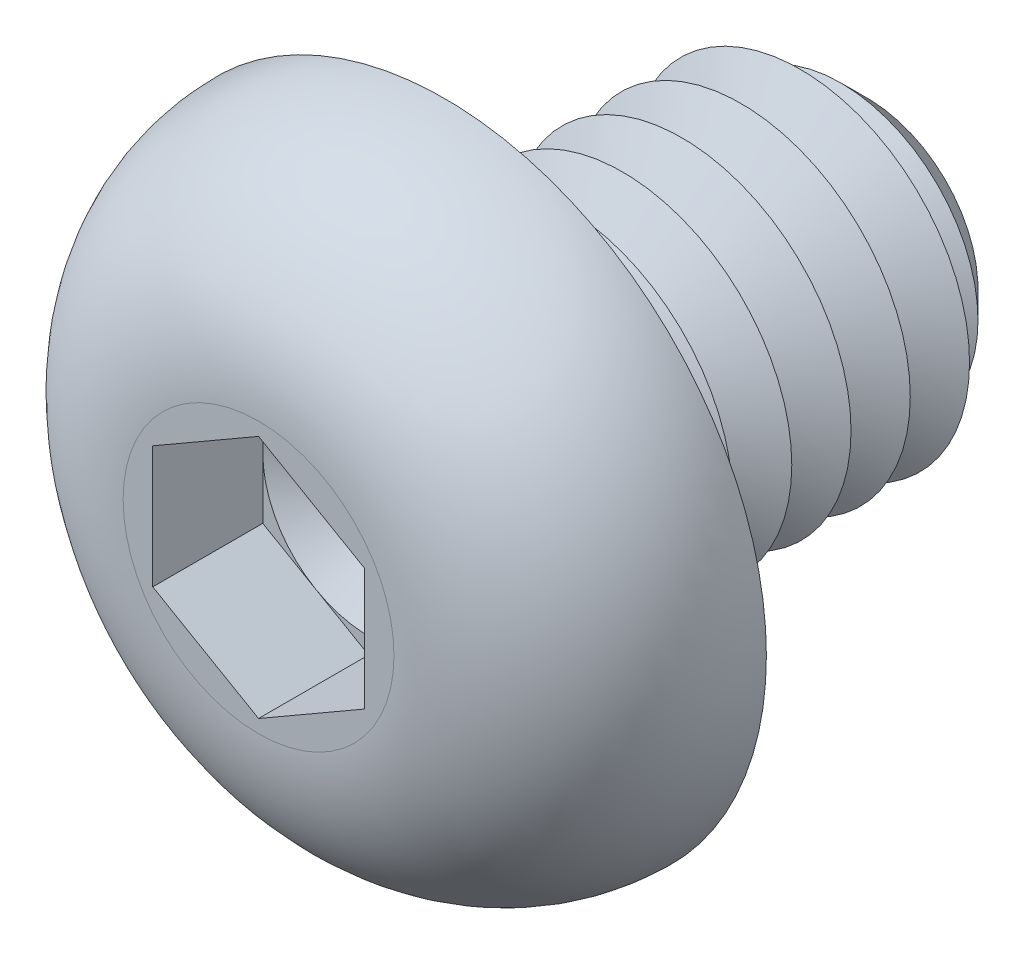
ISO-10303-21;
HEADER;
FILE_DESCRIPTION(('STEP AP214'),'2;1');
FILE_NAME('part.step','',(''),(''),'','','');
FILE_SCHEMA(('AUTOMOTIVE_DESIGN { 1 0 10303 214 1 1 1 1 }'));
ENDSEC;
DATA;
#1=APPLICATION_CONTEXT('core data for automotive mechanical design processes');
#2=APPLICATION_PROTOCOL_DEFINITION('international standard','automotive_design',2000,#1);
#3=PRODUCT_CONTEXT('',#1,'mechanical');
#4=PRODUCT('Part','Part','',(#3));
#5=PRODUCT_RELATED_PRODUCT_CATEGORY('part','',(#4));
#6=PRODUCT_DEFINITION_FORMATION('','',#4);
#7=PRODUCT_DEFINITION_CONTEXT('part definition',#1,'design');
#8=PRODUCT_DEFINITION('design','',#6,#7);
#9=PRODUCT_DEFINITION_SHAPE('','',#8);
#10=(LENGTH_UNIT() NAMED_UNIT(*) SI_UNIT(.MILLI.,.METRE.));
#11=(NAMED_UNIT(*) PLANE_ANGLE_UNIT() SI_UNIT($,.RADIAN.));
#12=(NAMED_UNIT(*) SI_UNIT($,.STERADIAN.) SOLID_ANGLE_UNIT());
#13=UNCERTAINTY_MEASURE_WITH_UNIT(LENGTH_MEASURE(1.E-05),#10,'distance_accuracy_value','');
#14=(GEOMETRIC_REPRESENTATION_CONTEXT(3) GLOBAL_UNCERTAINTY_ASSIGNED_CONTEXT((#13)) GLOBAL_UNIT_ASSIGNED_CONTEXT((#10,
#11,#12)) REPRESENTATION_CONTEXT('',''));
#15=CARTESIAN_POINT('',(0.,0.,0.));
#16=DIRECTION('',(0.,0.,1.));
#17=DIRECTION('',(1.,0.,0.));
#18=AXIS2_PLACEMENT_3D('',#15,#16,#17);
#19=CARTESIAN_POINT('',(0.,0.,0.900000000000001));
#20=DIRECTION('',(0.,0.,1.));
#21=DIRECTION('',(1.,0.,0.));
#22=AXIS2_PLACEMENT_3D('',#19,#20,#21);
#23=PLANE('',#22);
#24=CARTESIAN_POINT('',(0.,0.,0.900000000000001));
#25=DIRECTION('',(0.,0.,1.));
#26=DIRECTION('',(1.,0.,0.));
#27=AXIS2_PLACEMENT_3D('',#24,#25,#26);
#28=CIRCLE('',#27,1.25);
#29=CARTESIAN_POINT('',(1.25,0.,0.900000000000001));
#30=VERTEX_POINT('',#29);
#31=CARTESIAN_POINT('',(0.625,1.08253175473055,0.900000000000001));
#32=VERTEX_POINT('',#31);
#33=EDGE_CURVE('E117',#30,#32,#28,.T.);
#34=ORIENTED_EDGE('',*,*,#33,.F.);
#35=DIRECTION('',(0.,1.,0.));
#36=VECTOR('',#35,1.);
#37=CARTESIAN_POINT('',(1.25,-0.721687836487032,0.900000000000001));
#38=LINE('',#37,#36);
#39=CARTESIAN_POINT('',(1.25,0.721687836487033,0.900000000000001));
#40=VERTEX_POINT('',#39);
#41=EDGE_CURVE('E140',#30,#40,#38,.T.);
#42=ORIENTED_EDGE('',*,*,#41,.T.);
#43=DIRECTION('',(-0.866025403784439,0.5,0.));
#44=VECTOR('',#43,1.);
#45=CARTESIAN_POINT('',(1.25,0.721687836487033,0.900000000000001));
#46=LINE('',#45,#44);
#47=EDGE_CURVE('E135',#40,#32,#46,.T.);
#48=ORIENTED_EDGE('',*,*,#47,.T.);
#49=EDGE_LOOP('',(#34,#42,#48));
#50=FACE_BOUND('',#49,.T.);
#51=ADVANCED_FACE('F39',(#50),#23,.T.);
#52=CARTESIAN_POINT('',(0.,0.,0.900000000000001));
#53=DIRECTION('',(0.,0.,1.));
#54=DIRECTION('',(1.,0.,0.));
#55=AXIS2_PLACEMENT_3D('',#52,#53,#54);
#56=CIRCLE('',#55,1.25);
#57=CARTESIAN_POINT('',(-0.625,1.08253175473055,0.900000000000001));
#58=VERTEX_POINT('',#57);
#59=EDGE_CURVE('E11',#32,#58,#56,.T.);
#60=ORIENTED_EDGE('',*,*,#59,.F.);
#61=CARTESIAN_POINT('',(0.,1.44337567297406,0.900000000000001));
#62=VERTEX_POINT('',#61);
#63=EDGE_CURVE('E130',#32,#62,#46,.T.);
#64=ORIENTED_EDGE('',*,*,#63,.T.);
#65=DIRECTION('',(-0.866025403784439,-0.5,0.));
#66=VECTOR('',#65,1.);
#67=CARTESIAN_POINT('',(0.,1.44337567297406,0.900000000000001));
#68=LINE('',#67,#66);
#69=EDGE_CURVE('E132',#62,#58,#68,.T.);
#70=ORIENTED_EDGE('',*,*,#69,.T.);
#71=EDGE_LOOP('',(#60,#64,#70));
#72=FACE_BOUND('',#71,.T.);
#73=ADVANCED_FACE('F129',(#72),#23,.T.);
#74=CARTESIAN_POINT('',(-1.25,0.,0.900000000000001));
#75=VERTEX_POINT('',#74);
#76=EDGE_CURVE('E49',#58,#75,#56,.T.);
#77=ORIENTED_EDGE('',*,*,#76,.F.);
#78=CARTESIAN_POINT('',(-1.25,0.721687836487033,0.900000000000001));
#79=VERTEX_POINT('',#78);
#80=EDGE_CURVE('E143',#58,#79,#68,.T.);
#81=ORIENTED_EDGE('',*,*,#80,.T.);
#82=DIRECTION('',(0.,-1.,0.));
#83=VECTOR('',#82,1.);
#84=CARTESIAN_POINT('',(-1.25,0.721687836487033,0.900000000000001));
#85=LINE('',#84,#83);
#86=EDGE_CURVE('E154',#79,#75,#85,.T.);
#87=ORIENTED_EDGE('',*,*,#86,.T.);
#88=EDGE_LOOP('',(#77,#81,#87));
#89=FACE_BOUND('',#88,.T.);
#90=ADVANCED_FACE('F254',(#89),#23,.T.);
#91=CARTESIAN_POINT('',(-0.625,-1.08253175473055,0.900000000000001));
#92=VERTEX_POINT('',#91);
#93=EDGE_CURVE('E238',#75,#92,#56,.T.);
#94=ORIENTED_EDGE('',*,*,#93,.F.);
#95=CARTESIAN_POINT('',(-1.25,-0.721687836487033,0.900000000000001));
#96=VERTEX_POINT('',#95);
#97=EDGE_CURVE('E153',#75,#96,#85,.T.);
#98=ORIENTED_EDGE('',*,*,#97,.T.);
#99=DIRECTION('',(0.866025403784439,-0.5,0.));
#100=VECTOR('',#99,1.);
#101=CARTESIAN_POINT('',(-1.25,-0.721687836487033,0.900000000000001));
#102=LINE('',#101,#100);
#103=EDGE_CURVE('E159',#96,#92,#102,.T.);
#104=ORIENTED_EDGE('',*,*,#103,.T.);
#105=EDGE_LOOP('',(#94,#98,#104));
#106=FACE_BOUND('',#105,.T.);
#107=ADVANCED_FACE('F247',(#106),#23,.T.);
#108=CARTESIAN_POINT('',(0.625,-1.08253175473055,0.900000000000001));
#109=VERTEX_POINT('',#108);
#110=EDGE_CURVE('E56',#92,#109,#56,.T.);
#111=ORIENTED_EDGE('',*,*,#110,.F.);
#112=CARTESIAN_POINT('',(0.,-1.44337567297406,0.900000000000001));
#113=VERTEX_POINT('',#112);
#114=EDGE_CURVE('E158',#92,#113,#102,.T.);
#115=ORIENTED_EDGE('',*,*,#114,.T.);
#116=DIRECTION('',(0.866025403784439,0.5,0.));
#117=VECTOR('',#116,1.);
#118=CARTESIAN_POINT('',(0.,-1.44337567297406,0.900000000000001));
#119=LINE('',#118,#117);
#120=EDGE_CURVE('E164',#113,#109,#119,.T.);
#121=ORIENTED_EDGE('',*,*,#120,.T.);
#122=EDGE_LOOP('',(#111,#115,#121));
#123=FACE_BOUND('',#122,.T.);
#124=ADVANCED_FACE('F315',(#123),#23,.T.);
#125=CARTESIAN_POINT('',(0.,0.,-5.));
#126=DIRECTION('',(0.,0.,1.));
#127=DIRECTION('',(1.,0.,0.));
#128=AXIS2_PLACEMENT_3D('',#125,#126,#127);
#129=CYLINDRICAL_SURFACE('',#128,2.);
#130=CARTESIAN_POINT('',(0.,0.,-0.3));
#131=DIRECTION('',(0.,0.,1.));
#132=DIRECTION('',(1.,0.,0.));
#133=AXIS2_PLACEMENT_3D('',#130,#131,#132);
#134=CIRCLE('',#133,2.);
#135=CARTESIAN_POINT('',(2.,0.,-0.3));
#136=VERTEX_POINT('',#135);
#137=EDGE_CURVE('E220',#136,#136,#134,.F.);
#138=ORIENTED_EDGE('',*,*,#137,.T.);
#139=EDGE_LOOP('',(#138));
#140=FACE_BOUND('',#139,.T.);
#141=CARTESIAN_POINT('',(0.,0.,-0.699999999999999));
#142=DIRECTION('',(0.,0.,1.));
#143=DIRECTION('',(1.,0.,0.));
#144=AXIS2_PLACEMENT_3D('',#141,#142,#143);
#145=CIRCLE('',#144,2.);
#146=CARTESIAN_POINT('',(2.,0.,-0.699999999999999));
#147=VERTEX_POINT('',#146);
#148=EDGE_CURVE('E149',#147,#147,#145,.T.);
#149=ORIENTED_EDGE('',*,*,#148,.T.);
#150=EDGE_LOOP('',(#149));
#151=FACE_BOUND('',#150,.T.);
#152=ADVANCED_FACE('F299',(#140,#151),#129,.T.);
#153=CARTESIAN_POINT('',(0.,3.8,0.));
#154=DIRECTION('',(0.,0.,1.));
#155=DIRECTION('',(1.,0.,0.));
#156=AXIS2_PLACEMENT_3D('',#153,#154,#155);
#157=PLANE('',#156);
#158=CARTESIAN_POINT('',(0.,0.,0.));
#159=DIRECTION('',(0.,0.,1.));
#160=DIRECTION('',(1.,0.,0.));
#161=AXIS2_PLACEMENT_3D('',#158,#159,#160);
#162=CIRCLE('',#161,2.3);
#163=CARTESIAN_POINT('',(2.3,0.,0.));
#164=VERTEX_POINT('',#163);
#165=EDGE_CURVE('E229',#164,#164,#162,.T.);
#166=ORIENTED_EDGE('',*,*,#165,.T.);
#167=EDGE_LOOP('',(#166));
#168=FACE_BOUND('',#167,.T.);
#169=CARTESIAN_POINT('',(0.,0.,0.));
#170=DIRECTION('',(0.,0.,1.));
#171=DIRECTION('',(1.,0.,0.));
#172=AXIS2_PLACEMENT_3D('',#169,#170,#171);
#173=CIRCLE('',#172,3.8);
#174=CARTESIAN_POINT('',(3.8,0.,0.));
#175=VERTEX_POINT('',#174);
#176=EDGE_CURVE('E195',#175,#175,#173,.T.);
#177=ORIENTED_EDGE('',*,*,#176,.F.);
#178=EDGE_LOOP('',(#177));
#179=FACE_BOUND('',#178,.T.);
#180=ADVANCED_FACE('F345',(#168,#179),#157,.F.);
#181=CARTESIAN_POINT('',(0.,0.,2.2));
#182=DIRECTION('',(0.,0.,-1.));
#183=DIRECTION('',(-1.,0.,0.));
#184=AXIS2_PLACEMENT_3D('',#181,#182,#183);
#185=PLANE('',#184);
#186=DIRECTION('',(-0.866025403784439,-0.5,0.));
#187=VECTOR('',#186,1.);
#188=CARTESIAN_POINT('',(0.,1.44337567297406,2.2));
#189=LINE('',#188,#187);
#190=CARTESIAN_POINT('',(0.,1.44337567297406,2.2));
#191=VERTEX_POINT('',#190);
#192=CARTESIAN_POINT('',(-1.25,0.721687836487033,2.2));
#193=VERTEX_POINT('',#192);
#194=EDGE_CURVE('E174',#191,#193,#189,.T.);
#195=ORIENTED_EDGE('',*,*,#194,.F.);
#196=DIRECTION('',(-0.866025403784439,0.5,0.));
#197=VECTOR('',#196,1.);
#198=CARTESIAN_POINT('',(1.25,0.721687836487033,2.2));
#199=LINE('',#198,#197);
#200=CARTESIAN_POINT('',(1.25,0.721687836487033,2.2));
#201=VERTEX_POINT('',#200);
#202=EDGE_CURVE('E64',#201,#191,#199,.T.);
#203=ORIENTED_EDGE('',*,*,#202,.F.);
#204=DIRECTION('',(0.,1.,0.));
#205=VECTOR('',#204,1.);
#206=CARTESIAN_POINT('',(1.25,-0.721687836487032,2.2));
#207=LINE('',#206,#205);
#208=CARTESIAN_POINT('',(1.25,-0.721687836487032,2.2));
#209=VERTEX_POINT('',#208);
#210=EDGE_CURVE('E138',#209,#201,#207,.T.);
#211=ORIENTED_EDGE('',*,*,#210,.F.);
#212=DIRECTION('',(0.866025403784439,0.5,0.));
#213=VECTOR('',#212,1.);
#214=CARTESIAN_POINT('',(0.,-1.44337567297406,2.2));
#215=LINE('',#214,#213);
#216=CARTESIAN_POINT('',(0.,-1.44337567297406,2.2));
#217=VERTEX_POINT('',#216);
#218=EDGE_CURVE('E185',#217,#209,#215,.T.);
#219=ORIENTED_EDGE('',*,*,#218,.F.);
#220=DIRECTION('',(0.866025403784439,-0.5,0.));
#221=VECTOR('',#220,1.);
#222=CARTESIAN_POINT('',(-1.25,-0.721687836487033,2.2));
#223=LINE('',#222,#221);
#224=CARTESIAN_POINT('',(-1.25,-0.721687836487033,2.2));
#225=VERTEX_POINT('',#224);
#226=EDGE_CURVE('E181',#225,#217,#223,.T.);
#227=ORIENTED_EDGE('',*,*,#226,.F.);
#228=DIRECTION('',(0.,-1.,0.));
#229=VECTOR('',#228,1.);
#230=CARTESIAN_POINT('',(-1.25,0.721687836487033,2.2));
#231=LINE('',#230,#229);
#232=EDGE_CURVE('E178',#193,#225,#231,.T.);
#233=ORIENTED_EDGE('',*,*,#232,.F.);
#234=EDGE_LOOP('',(#195,#203,#211,#219,#227,#233));
#235=FACE_BOUND('',#234,.T.);
#236=CARTESIAN_POINT('',(0.,0.,2.2));
#237=DIRECTION('',(0.,0.,1.));
#238=DIRECTION('',(1.,0.,0.));
#239=AXIS2_PLACEMENT_3D('',#236,#237,#238);
#240=CIRCLE('',#239,1.6);
#241=CARTESIAN_POINT('',(1.6,0.,2.2));
#242=VERTEX_POINT('',#241);
#243=EDGE_CURVE('E212',#242,#242,#240,.T.);
#244=ORIENTED_EDGE('',*,*,#243,.T.);
#245=EDGE_LOOP('',(#244));
#246=FACE_BOUND('',#245,.T.);
#247=ADVANCED_FACE('F263',(#235,#246),#185,.F.);
#248=CARTESIAN_POINT('',(0.,0.,0.));
#249=DIRECTION('',(0.,0.,1.));
#250=DIRECTION('',(1.,0.,0.));
#251=AXIS2_PLACEMENT_3D('',#248,#249,#250);
#252=DEGENERATE_TOROIDAL_SURFACE('',#251,1.6,2.2,.T.);
#253=ORIENTED_EDGE('',*,*,#243,.F.);
#254=EDGE_LOOP('',(#253));
#255=FACE_BOUND('',#254,.T.);
#256=ORIENTED_EDGE('',*,*,#176,.T.);
#257=EDGE_LOOP('',(#256));
#258=FACE_BOUND('',#257,.T.);
#259=ADVANCED_FACE('F339',(#255,#258),#252,.T.);
#260=CARTESIAN_POINT('',(1.25,0.721687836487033,0.900000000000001));
#261=DIRECTION('',(0.5,0.866025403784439,0.));
#262=DIRECTION('',(-0.866025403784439,0.5,0.));
#263=AXIS2_PLACEMENT_3D('',#260,#261,#262);
#264=PLANE('',#263);
#265=ORIENTED_EDGE('',*,*,#202,.T.);
#266=DIRECTION('',(0.,0.,1.));
#267=VECTOR('',#266,1.);
#268=CARTESIAN_POINT('',(0.,1.44337567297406,0.900000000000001));
#269=LINE('',#268,#267);
#270=EDGE_CURVE('E136',#62,#191,#269,.T.);
#271=ORIENTED_EDGE('',*,*,#270,.F.);
#272=ORIENTED_EDGE('',*,*,#63,.F.);
#273=ORIENTED_EDGE('',*,*,#47,.F.);
#274=DIRECTION('',(0.,0.,1.));
#275=VECTOR('',#274,1.);
#276=CARTESIAN_POINT('',(1.25,0.721687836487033,0.900000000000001));
#277=LINE('',#276,#275);
#278=EDGE_CURVE('E192',#40,#201,#277,.T.);
#279=ORIENTED_EDGE('',*,*,#278,.T.);
#280=EDGE_LOOP('',(#265,#271,#272,#273,#279));
#281=FACE_BOUND('',#280,.T.);
#282=ADVANCED_FACE('F134',(#281),#264,.F.);
#283=CARTESIAN_POINT('',(1.25,-0.721687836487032,0.900000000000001));
#284=DIRECTION('',(1.,0.,0.));
#285=DIRECTION('',(0.,1.,0.));
#286=AXIS2_PLACEMENT_3D('',#283,#284,#285);
#287=PLANE('',#286);
#288=ORIENTED_EDGE('',*,*,#210,.T.);
#289=ORIENTED_EDGE('',*,*,#278,.F.);
#290=ORIENTED_EDGE('',*,*,#41,.F.);
#291=CARTESIAN_POINT('',(1.25,-0.721687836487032,0.900000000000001));
#292=VERTEX_POINT('',#291);
#293=EDGE_CURVE('E168',#292,#30,#38,.T.);
#294=ORIENTED_EDGE('',*,*,#293,.F.);
#295=DIRECTION('',(0.,0.,1.));
#296=VECTOR('',#295,1.);
#297=CARTESIAN_POINT('',(1.25,-0.721687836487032,0.900000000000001));
#298=LINE('',#297,#296);
#299=EDGE_CURVE('E196',#292,#209,#298,.T.);
#300=ORIENTED_EDGE('',*,*,#299,.T.);
#301=EDGE_LOOP('',(#288,#289,#290,#294,#300));
#302=FACE_BOUND('',#301,.T.);
#303=ADVANCED_FACE('F323',(#302),#287,.F.);
#304=CARTESIAN_POINT('',(0.,-1.44337567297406,0.900000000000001));
#305=DIRECTION('',(0.5,-0.866025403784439,0.));
#306=DIRECTION('',(0.866025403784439,0.5,0.));
#307=AXIS2_PLACEMENT_3D('',#304,#305,#306);
#308=PLANE('',#307);
#309=ORIENTED_EDGE('',*,*,#218,.T.);
#310=ORIENTED_EDGE('',*,*,#299,.F.);
#311=EDGE_CURVE('E163',#109,#292,#119,.T.);
#312=ORIENTED_EDGE('',*,*,#311,.F.);
#313=ORIENTED_EDGE('',*,*,#120,.F.);
#314=DIRECTION('',(0.,0.,1.));
#315=VECTOR('',#314,1.);
#316=CARTESIAN_POINT('',(0.,-1.44337567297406,0.900000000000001));
#317=LINE('',#316,#315);
#318=EDGE_CURVE('E199',#113,#217,#317,.T.);
#319=ORIENTED_EDGE('',*,*,#318,.T.);
#320=EDGE_LOOP('',(#309,#310,#312,#313,#319));
#321=FACE_BOUND('',#320,.T.);
#322=ADVANCED_FACE('F326',(#321),#308,.F.);
#323=CARTESIAN_POINT('',(-1.25,-0.721687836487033,0.900000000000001));
#324=DIRECTION('',(-0.5,-0.866025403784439,0.));
#325=DIRECTION('',(0.866025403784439,-0.5,0.));
#326=AXIS2_PLACEMENT_3D('',#323,#324,#325);
#327=PLANE('',#326);
#328=ORIENTED_EDGE('',*,*,#226,.T.);
#329=ORIENTED_EDGE('',*,*,#318,.F.);
#330=ORIENTED_EDGE('',*,*,#114,.F.);
#331=ORIENTED_EDGE('',*,*,#103,.F.);
#332=DIRECTION('',(0.,0.,1.));
#333=VECTOR('',#332,1.);
#334=CARTESIAN_POINT('',(-1.25,-0.721687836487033,0.900000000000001));
#335=LINE('',#334,#333);
#336=EDGE_CURVE('E201',#96,#225,#335,.T.);
#337=ORIENTED_EDGE('',*,*,#336,.T.);
#338=EDGE_LOOP('',(#328,#329,#330,#331,#337));
#339=FACE_BOUND('',#338,.T.);
#340=ADVANCED_FACE('F268',(#339),#327,.F.);
#341=CARTESIAN_POINT('',(-1.25,0.721687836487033,0.900000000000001));
#342=DIRECTION('',(-1.,0.,0.));
#343=DIRECTION('',(0.,0.,1.));
#344=AXIS2_PLACEMENT_3D('',#341,#342,#343);
#345=PLANE('',#344);
#346=ORIENTED_EDGE('',*,*,#232,.T.);
#347=ORIENTED_EDGE('',*,*,#336,.F.);
#348=ORIENTED_EDGE('',*,*,#97,.F.);
#349=ORIENTED_EDGE('',*,*,#86,.F.);
#350=DIRECTION('',(0.,0.,1.));
#351=VECTOR('',#350,1.);
#352=CARTESIAN_POINT('',(-1.25,0.721687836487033,0.900000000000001));
#353=LINE('',#352,#351);
#354=EDGE_CURVE('E204',#79,#193,#353,.T.);
#355=ORIENTED_EDGE('',*,*,#354,.T.);
#356=EDGE_LOOP('',(#346,#347,#348,#349,#355));
#357=FACE_BOUND('',#356,.T.);
#358=ADVANCED_FACE('F252',(#357),#345,.F.);
#359=CARTESIAN_POINT('',(0.,1.44337567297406,0.900000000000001));
#360=DIRECTION('',(-0.5,0.866025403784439,0.));
#361=DIRECTION('',(-0.866025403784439,-0.5,0.));
#362=AXIS2_PLACEMENT_3D('',#359,#360,#361);
#363=PLANE('',#362);
#364=ORIENTED_EDGE('',*,*,#194,.T.);
#365=ORIENTED_EDGE('',*,*,#354,.F.);
#366=ORIENTED_EDGE('',*,*,#80,.F.);
#367=ORIENTED_EDGE('',*,*,#69,.F.);
#368=ORIENTED_EDGE('',*,*,#270,.T.);
#369=EDGE_LOOP('',(#364,#365,#366,#367,#368));
#370=FACE_BOUND('',#369,.T.);
#371=ADVANCED_FACE('F257',(#370),#363,.F.);
#372=EDGE_CURVE('E43',#109,#30,#56,.T.);
#373=ORIENTED_EDGE('',*,*,#372,.F.);
#374=ORIENTED_EDGE('',*,*,#311,.T.);
#375=ORIENTED_EDGE('',*,*,#293,.T.);
#376=EDGE_LOOP('',(#373,#374,#375));
#377=FACE_BOUND('',#376,.T.);
#378=ADVANCED_FACE('F304',(#377),#23,.T.);
#379=CARTESIAN_POINT('',(0.,0.,-0.699999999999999));
#380=DIRECTION('',(0.,0.,1.));
#381=DIRECTION('',(1.,0.,0.));
#382=AXIS2_PLACEMENT_3D('',#379,#380,#381);
#383=CONICAL_SURFACE('',#382,2.,1.04719755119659);
#384=CARTESIAN_POINT('',(0.,0.,-1.05));
#385=DIRECTION('',(0.,0.,1.));
#386=DIRECTION('',(1.,0.,0.));
#387=AXIS2_PLACEMENT_3D('',#384,#385,#386);
#388=CIRCLE('',#387,1.3937822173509);
#389=CARTESIAN_POINT('',(1.3937822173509,0.,-1.05));
#390=VERTEX_POINT('',#389);
#391=EDGE_CURVE('E283',#390,#390,#388,.T.);
#392=ORIENTED_EDGE('',*,*,#391,.T.);
#393=EDGE_LOOP('',(#392));
#394=FACE_BOUND('',#393,.T.);
#395=ORIENTED_EDGE('',*,*,#148,.F.);
#396=EDGE_LOOP('',(#395));
#397=FACE_BOUND('',#396,.T.);
#398=ADVANCED_FACE('F301',(#394,#397),#383,.T.);
#399=CARTESIAN_POINT('',(0.,0.,-1.05));
#400=DIRECTION('',(0.,0.,-1.));
#401=DIRECTION('',(-1.,0.,0.));
#402=AXIS2_PLACEMENT_3D('',#399,#400,#401);
#403=CONICAL_SURFACE('',#402,1.3937822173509,1.0471975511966);
#404=CARTESIAN_POINT('',(0.,0.,-1.4));
#405=DIRECTION('',(0.,0.,1.));
#406=DIRECTION('',(1.,0.,0.));
#407=AXIS2_PLACEMENT_3D('',#404,#405,#406);
#408=CIRCLE('',#407,2.);
#409=CARTESIAN_POINT('',(2.,0.,-1.4));
#410=VERTEX_POINT('',#409);
#411=EDGE_CURVE('E276',#410,#410,#408,.T.);
#412=ORIENTED_EDGE('',*,*,#411,.T.);
#413=EDGE_LOOP('',(#412));
#414=FACE_BOUND('',#413,.T.);
#415=ORIENTED_EDGE('',*,*,#391,.F.);
#416=EDGE_LOOP('',(#415));
#417=FACE_BOUND('',#416,.T.);
#418=ADVANCED_FACE('F303',(#414,#417),#403,.T.);
#419=CARTESIAN_POINT('',(0.,0.,-1.4));
#420=DIRECTION('',(0.,0.,1.));
#421=DIRECTION('',(1.,0.,0.));
#422=AXIS2_PLACEMENT_3D('',#419,#420,#421);
#423=CONICAL_SURFACE('',#422,2.,1.04719755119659);
#424=CARTESIAN_POINT('',(0.,0.,-1.75));
#425=DIRECTION('',(0.,0.,1.));
#426=DIRECTION('',(1.,0.,0.));
#427=AXIS2_PLACEMENT_3D('',#424,#425,#426);
#428=CIRCLE('',#427,1.3937822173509);
#429=CARTESIAN_POINT('',(1.3937822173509,0.,-1.75));
#430=VERTEX_POINT('',#429);
#431=EDGE_CURVE('E274',#430,#430,#428,.T.);
#432=ORIENTED_EDGE('',*,*,#431,.T.);
#433=EDGE_LOOP('',(#432));
#434=FACE_BOUND('',#433,.T.);
#435=ORIENTED_EDGE('',*,*,#411,.F.);
#436=EDGE_LOOP('',(#435));
#437=FACE_BOUND('',#436,.T.);
#438=ADVANCED_FACE('F310',(#434,#437),#423,.T.);
#439=CARTESIAN_POINT('',(0.,0.,-1.75));
#440=DIRECTION('',(0.,0.,-1.));
#441=DIRECTION('',(-1.,0.,0.));
#442=AXIS2_PLACEMENT_3D('',#439,#440,#441);
#443=CONICAL_SURFACE('',#442,1.3937822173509,1.0471975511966);
#444=CARTESIAN_POINT('',(0.,0.,-2.1));
#445=DIRECTION('',(0.,0.,1.));
#446=DIRECTION('',(1.,0.,0.));
#447=AXIS2_PLACEMENT_3D('',#444,#445,#446);
#448=CIRCLE('',#447,2.);
#449=CARTESIAN_POINT('',(2.,0.,-2.1));
#450=VERTEX_POINT('',#449);
#451=EDGE_CURVE('E277',#450,#450,#448,.T.);
#452=ORIENTED_EDGE('',*,*,#451,.T.);
#453=EDGE_LOOP('',(#452));
#454=FACE_BOUND('',#453,.T.);
#455=ORIENTED_EDGE('',*,*,#431,.F.);
#456=EDGE_LOOP('',(#455));
#457=FACE_BOUND('',#456,.T.);
#458=ADVANCED_FACE('F405',(#454,#457),#443,.T.);
#459=CARTESIAN_POINT('',(0.,0.,-2.1));
#460=DIRECTION('',(0.,0.,1.));
#461=DIRECTION('',(1.,0.,0.));
#462=AXIS2_PLACEMENT_3D('',#459,#460,#461);
#463=CONICAL_SURFACE('',#462,2.,1.04719755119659);
#464=CARTESIAN_POINT('',(0.,0.,-2.45));
#465=DIRECTION('',(0.,0.,1.));
#466=DIRECTION('',(1.,0.,0.));
#467=AXIS2_PLACEMENT_3D('',#464,#465,#466);
#468=CIRCLE('',#467,1.3937822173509);
#469=CARTESIAN_POINT('',(1.3937822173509,0.,-2.45));
#470=VERTEX_POINT('',#469);
#471=EDGE_CURVE('E287',#470,#470,#468,.T.);
#472=ORIENTED_EDGE('',*,*,#471,.T.);
#473=EDGE_LOOP('',(#472));
#474=FACE_BOUND('',#473,.T.);
#475=ORIENTED_EDGE('',*,*,#451,.F.);
#476=EDGE_LOOP('',(#475));
#477=FACE_BOUND('',#476,.T.);
#478=ADVANCED_FACE('F390',(#474,#477),#463,.T.);
#479=CARTESIAN_POINT('',(0.,0.,-2.45));
#480=DIRECTION('',(0.,0.,-1.));
#481=DIRECTION('',(-1.,0.,0.));
#482=AXIS2_PLACEMENT_3D('',#479,#480,#481);
#483=CONICAL_SURFACE('',#482,1.3937822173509,1.0471975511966);
#484=CARTESIAN_POINT('',(0.,0.,-2.8));
#485=DIRECTION('',(0.,0.,1.));
#486=DIRECTION('',(1.,0.,0.));
#487=AXIS2_PLACEMENT_3D('',#484,#485,#486);
#488=CIRCLE('',#487,2.);
#489=CARTESIAN_POINT('',(2.,0.,-2.8));
#490=VERTEX_POINT('',#489);
#491=EDGE_CURVE('E385',#490,#490,#488,.T.);
#492=ORIENTED_EDGE('',*,*,#491,.T.);
#493=EDGE_LOOP('',(#492));
#494=FACE_BOUND('',#493,.T.);
#495=ORIENTED_EDGE('',*,*,#471,.F.);
#496=EDGE_LOOP('',(#495));
#497=FACE_BOUND('',#496,.T.);
#498=ADVANCED_FACE('F393',(#494,#497),#483,.T.);
#499=CARTESIAN_POINT('',(0.,0.,-2.8));
#500=DIRECTION('',(0.,0.,1.));
#501=DIRECTION('',(1.,0.,0.));
#502=AXIS2_PLACEMENT_3D('',#499,#500,#501);
#503=CONICAL_SURFACE('',#502,2.,1.04719755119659);
#504=CARTESIAN_POINT('',(0.,0.,-3.15));
#505=DIRECTION('',(0.,0.,1.));
#506=DIRECTION('',(1.,0.,0.));
#507=AXIS2_PLACEMENT_3D('',#504,#505,#506);
#508=CIRCLE('',#507,1.3937822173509);
#509=CARTESIAN_POINT('',(1.3937822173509,0.,-3.15));
#510=VERTEX_POINT('',#509);
#511=EDGE_CURVE('E381',#510,#510,#508,.T.);
#512=ORIENTED_EDGE('',*,*,#511,.T.);
#513=EDGE_LOOP('',(#512));
#514=FACE_BOUND('',#513,.T.);
#515=ORIENTED_EDGE('',*,*,#491,.F.);
#516=EDGE_LOOP('',(#515));
#517=FACE_BOUND('',#516,.T.);
#518=ADVANCED_FACE('F395',(#514,#517),#503,.T.);
#519=CARTESIAN_POINT('',(0.,0.,-3.15));
#520=DIRECTION('',(0.,0.,-1.));
#521=DIRECTION('',(-1.,0.,0.));
#522=AXIS2_PLACEMENT_3D('',#519,#520,#521);
#523=CONICAL_SURFACE('',#522,1.3937822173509,1.0471975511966);
#524=CARTESIAN_POINT('',(0.,0.,-3.5));
#525=DIRECTION('',(0.,0.,1.));
#526=DIRECTION('',(1.,0.,0.));
#527=AXIS2_PLACEMENT_3D('',#524,#525,#526);
#528=CIRCLE('',#527,2.);
#529=CARTESIAN_POINT('',(2.,0.,-3.5));
#530=VERTEX_POINT('',#529);
#531=EDGE_CURVE('E377',#530,#530,#528,.T.);
#532=ORIENTED_EDGE('',*,*,#531,.T.);
#533=EDGE_LOOP('',(#532));
#534=FACE_BOUND('',#533,.T.);
#535=ORIENTED_EDGE('',*,*,#511,.F.);
#536=EDGE_LOOP('',(#535));
#537=FACE_BOUND('',#536,.T.);
#538=ADVANCED_FACE('F402',(#534,#537),#523,.T.);
#539=CARTESIAN_POINT('',(0.,0.,-3.5));
#540=DIRECTION('',(0.,0.,1.));
#541=DIRECTION('',(1.,0.,0.));
#542=AXIS2_PLACEMENT_3D('',#539,#540,#541);
#543=CONICAL_SURFACE('',#542,2.,1.04719755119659);
#544=CARTESIAN_POINT('',(0.,0.,-3.85));
#545=DIRECTION('',(0.,0.,1.));
#546=DIRECTION('',(1.,0.,0.));
#547=AXIS2_PLACEMENT_3D('',#544,#545,#546);
#548=CIRCLE('',#547,1.3937822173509);
#549=CARTESIAN_POINT('',(1.3937822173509,0.,-3.85));
#550=VERTEX_POINT('',#549);
#551=EDGE_CURVE('E225',#550,#550,#548,.T.);
#552=ORIENTED_EDGE('',*,*,#551,.T.);
#553=EDGE_LOOP('',(#552));
#554=FACE_BOUND('',#553,.T.);
#555=ORIENTED_EDGE('',*,*,#531,.F.);
#556=EDGE_LOOP('',(#555));
#557=FACE_BOUND('',#556,.T.);
#558=ADVANCED_FACE('F441',(#554,#557),#543,.T.);
#559=CARTESIAN_POINT('',(0.,0.,-3.85));
#560=DIRECTION('',(0.,0.,-1.));
#561=DIRECTION('',(-1.,0.,0.));
#562=AXIS2_PLACEMENT_3D('',#559,#560,#561);
#563=CONICAL_SURFACE('',#562,1.3937822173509,1.0471975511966);
#564=CARTESIAN_POINT('',(0.,0.,-4.2));
#565=DIRECTION('',(0.,0.,1.));
#566=DIRECTION('',(1.,0.,0.));
#567=AXIS2_PLACEMENT_3D('',#564,#565,#566);
#568=CIRCLE('',#567,2.);
#569=CARTESIAN_POINT('',(2.,0.,-4.2));
#570=VERTEX_POINT('',#569);
#571=EDGE_CURVE('E226',#570,#570,#568,.T.);
#572=ORIENTED_EDGE('',*,*,#571,.T.);
#573=EDGE_LOOP('',(#572));
#574=FACE_BOUND('',#573,.T.);
#575=ORIENTED_EDGE('',*,*,#551,.F.);
#576=EDGE_LOOP('',(#575));
#577=FACE_BOUND('',#576,.T.);
#578=ADVANCED_FACE('F449',(#574,#577),#563,.T.);
#579=CARTESIAN_POINT('',(0.,0.,-4.2));
#580=DIRECTION('',(0.,0.,1.));
#581=DIRECTION('',(1.,0.,0.));
#582=AXIS2_PLACEMENT_3D('',#579,#580,#581);
#583=CONICAL_SURFACE('',#582,2.,1.04719755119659);
#584=CARTESIAN_POINT('',(0.,0.,-4.55));
#585=DIRECTION('',(0.,0.,1.));
#586=DIRECTION('',(1.,0.,0.));
#587=AXIS2_PLACEMENT_3D('',#584,#585,#586);
#588=CIRCLE('',#587,1.3937822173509);
#589=CARTESIAN_POINT('',(1.3937822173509,0.,-4.55));
#590=VERTEX_POINT('',#589);
#591=EDGE_CURVE('E124',#590,#590,#588,.T.);
#592=ORIENTED_EDGE('',*,*,#591,.T.);
#593=EDGE_LOOP('',(#592));
#594=FACE_BOUND('',#593,.T.);
#595=ORIENTED_EDGE('',*,*,#571,.F.);
#596=EDGE_LOOP('',(#595));
#597=FACE_BOUND('',#596,.T.);
#598=ADVANCED_FACE('F364',(#594,#597),#583,.T.);
#599=CARTESIAN_POINT('',(0.,0.,-4.55));
#600=DIRECTION('',(0.,0.,-1.));
#601=DIRECTION('',(-1.,0.,0.));
#602=AXIS2_PLACEMENT_3D('',#599,#600,#601);
#603=CONICAL_SURFACE('',#602,1.3937822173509,1.0471975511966);
#604=CARTESIAN_POINT('',(0.,0.,-4.68038475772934));
#605=DIRECTION('',(0.,0.,-1.));
#606=DIRECTION('',(-1.,0.,0.));
#607=AXIS2_PLACEMENT_3D('',#604,#605,#606);
#608=CIRCLE('',#607,1.61961524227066);
#609=CARTESIAN_POINT('',(-1.61961524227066,0.,-4.68038475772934));
#610=VERTEX_POINT('',#609);
#611=EDGE_CURVE('E221',#610,#610,#608,.T.);
#612=ORIENTED_EDGE('',*,*,#611,.F.);
#613=EDGE_LOOP('',(#612));
#614=FACE_BOUND('',#613,.T.);
#615=ORIENTED_EDGE('',*,*,#591,.F.);
#616=EDGE_LOOP('',(#615));
#617=FACE_BOUND('',#616,.T.);
#618=ADVANCED_FACE('F356',(#614,#617),#603,.T.);
#619=CARTESIAN_POINT('',(0.,0.,-5.));
#620=DIRECTION('',(0.,0.,-1.));
#621=DIRECTION('',(-1.,0.,0.));
#622=AXIS2_PLACEMENT_3D('',#619,#620,#621);
#623=PLANE('',#622);
#624=CARTESIAN_POINT('',(0.,0.,-5.));
#625=DIRECTION('',(0.,0.,-1.));
#626=DIRECTION('',(-1.,0.,0.));
#627=AXIS2_PLACEMENT_3D('',#624,#625,#626);
#628=CIRCLE('',#627,1.3);
#629=CARTESIAN_POINT('',(-1.3,0.,-5.));
#630=VERTEX_POINT('',#629);
#631=EDGE_CURVE('E216',#630,#630,#628,.T.);
#632=ORIENTED_EDGE('',*,*,#631,.T.);
#633=EDGE_LOOP('',(#632));
#634=FACE_BOUND('',#633,.T.);
#635=ADVANCED_FACE('F349',(#634),#623,.T.);
#636=CARTESIAN_POINT('',(0.,0.,-5.));
#637=DIRECTION('',(0.,0.,1.));
#638=DIRECTION('',(1.,0.,0.));
#639=AXIS2_PLACEMENT_3D('',#636,#637,#638);
#640=CONICAL_SURFACE('',#639,1.3,0.785398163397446);
#641=ORIENTED_EDGE('',*,*,#631,.F.);
#642=EDGE_LOOP('',(#641));
#643=FACE_BOUND('',#642,.T.);
#644=ORIENTED_EDGE('',*,*,#611,.T.);
#645=EDGE_LOOP('',(#644));
#646=FACE_BOUND('',#645,.T.);
#647=ADVANCED_FACE('F347',(#643,#646),#640,.T.);
#648=CARTESIAN_POINT('',(0.,0.,-0.3));
#649=DIRECTION('',(0.,0.,1.));
#650=DIRECTION('',(1.,0.,0.));
#651=AXIS2_PLACEMENT_3D('',#648,#649,#650);
#652=TOROIDAL_SURFACE('',#651,2.3,0.3);
#653=ORIENTED_EDGE('',*,*,#165,.F.);
#654=EDGE_LOOP('',(#653));
#655=FACE_BOUND('',#654,.T.);
#656=ORIENTED_EDGE('',*,*,#137,.F.);
#657=EDGE_LOOP('',(#656));
#658=FACE_BOUND('',#657,.T.);
#659=ADVANCED_FACE('F41',(#655,#658),#652,.F.);
#660=CARTESIAN_POINT('',(0.,0.,0.900000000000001));
#661=DIRECTION('',(0.,0.,1.));
#662=DIRECTION('',(1.,0.,0.));
#663=AXIS2_PLACEMENT_3D('',#660,#661,#662);
#664=CONICAL_SURFACE('',#663,1.25,1.0471975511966);
#665=CARTESIAN_POINT('',(0.,0.,0.178312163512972));
#666=VERTEX_POINT('',#665);
#667=VERTEX_LOOP('',#666);
#668=FACE_BOUND('',#667,.T.);
#669=ORIENTED_EDGE('',*,*,#33,.T.);
#670=ORIENTED_EDGE('',*,*,#59,.T.);
#671=ORIENTED_EDGE('',*,*,#76,.T.);
#672=ORIENTED_EDGE('',*,*,#93,.T.);
#673=ORIENTED_EDGE('',*,*,#110,.T.);
#674=ORIENTED_EDGE('',*,*,#372,.T.);
#675=EDGE_LOOP('',(#669,#670,#671,#672,#673,#674));
#676=FACE_BOUND('',#675,.T.);
#677=ADVANCED_FACE('F113',(#668,#676),#664,.F.);
#678=CLOSED_SHELL('',(#51,#73,#90,#107,#124,#152,#180,#247,#259,#282,#303,#322,#340,#358,#371,
#378,#398,#418,#438,#458,#478,#498,#518,#538,#558,#578,#598,#618,#635,#647,#659,#677));
#679=MANIFOLD_SOLID_BREP('B2',#678);
#680=ADVANCED_BREP_SHAPE_REPRESENTATION('',(#18,#679),#14);
#681=SHAPE_DEFINITION_REPRESENTATION(#9,#680);
ENDSEC;
END-ISO-10303-21;
